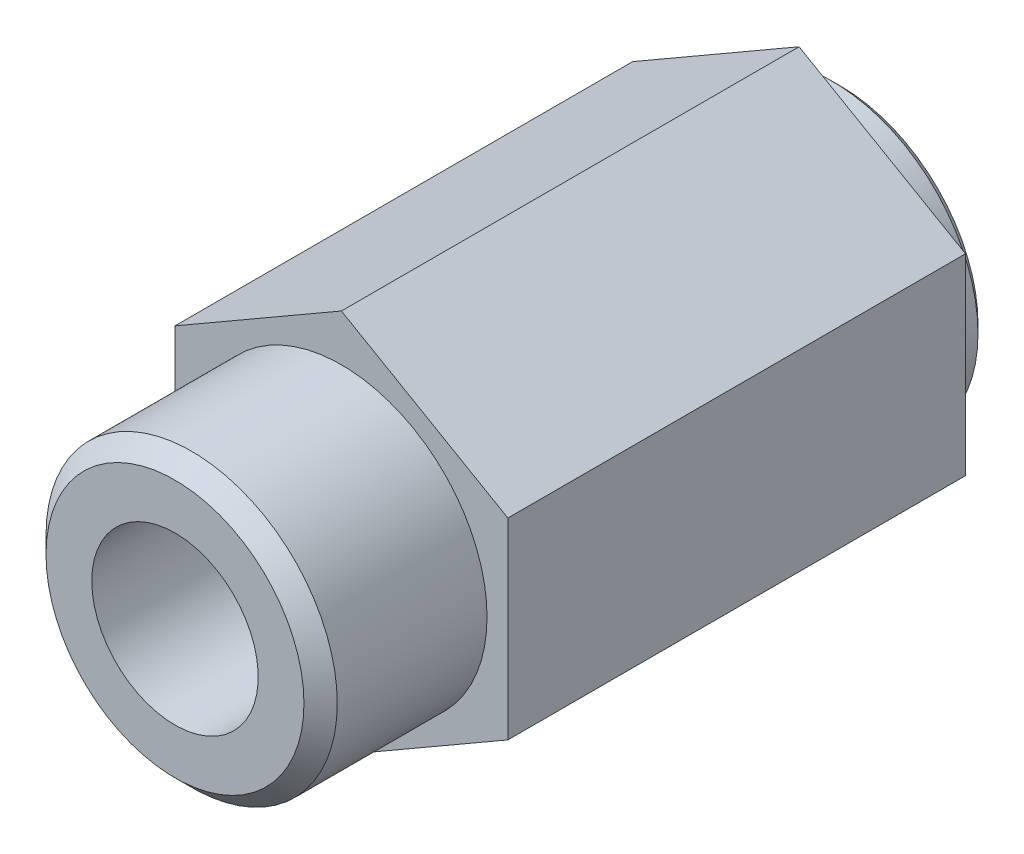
ISO-10303-21;
HEADER;
FILE_DESCRIPTION(('STEP AP214'),'2;1');
FILE_NAME('part.step','',(''),(''),'','','');
FILE_SCHEMA(('AUTOMOTIVE_DESIGN { 1 0 10303 214 1 1 1 1 }'));
ENDSEC;
DATA;
#1=APPLICATION_CONTEXT('core data for automotive mechanical design processes');
#2=APPLICATION_PROTOCOL_DEFINITION('international standard','automotive_design',2000,#1);
#3=PRODUCT_CONTEXT('',#1,'mechanical');
#4=PRODUCT('Part','Part','',(#3));
#5=PRODUCT_RELATED_PRODUCT_CATEGORY('part','',(#4));
#6=PRODUCT_DEFINITION_FORMATION('','',#4);
#7=PRODUCT_DEFINITION_CONTEXT('part definition',#1,'design');
#8=PRODUCT_DEFINITION('design','',#6,#7);
#9=PRODUCT_DEFINITION_SHAPE('','',#8);
#10=(LENGTH_UNIT() NAMED_UNIT(*) SI_UNIT(.MILLI.,.METRE.));
#11=(NAMED_UNIT(*) PLANE_ANGLE_UNIT() SI_UNIT($,.RADIAN.));
#12=(NAMED_UNIT(*) SI_UNIT($,.STERADIAN.) SOLID_ANGLE_UNIT());
#13=UNCERTAINTY_MEASURE_WITH_UNIT(LENGTH_MEASURE(1.E-05),#10,'distance_accuracy_value','');
#14=(GEOMETRIC_REPRESENTATION_CONTEXT(3) GLOBAL_UNCERTAINTY_ASSIGNED_CONTEXT((#13)) GLOBAL_UNIT_ASSIGNED_CONTEXT((#10,
#11,#12)) REPRESENTATION_CONTEXT('',''));
#15=CARTESIAN_POINT('',(0.,0.,0.));
#16=DIRECTION('',(0.,0.,1.));
#17=DIRECTION('',(1.,0.,0.));
#18=AXIS2_PLACEMENT_3D('',#15,#16,#17);
#19=CARTESIAN_POINT('',(20.,11.5470053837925,55.));
#20=DIRECTION('',(-0.5,-0.866025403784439,0.));
#21=DIRECTION('',(0.866025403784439,-0.5,0.));
#22=AXIS2_PLACEMENT_3D('',#19,#20,#21);
#23=PLANE('',#22);
#24=DIRECTION('',(-0.866025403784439,0.5,0.));
#25=VECTOR('',#24,1.);
#26=CARTESIAN_POINT('',(20.,11.5470053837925,0.));
#27=LINE('',#26,#25);
#28=CARTESIAN_POINT('',(20.,11.5470053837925,0.));
#29=VERTEX_POINT('',#28);
#30=CARTESIAN_POINT('',(0.,23.094010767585,0.));
#31=VERTEX_POINT('',#30);
#32=EDGE_CURVE('E125',#29,#31,#27,.T.);
#33=ORIENTED_EDGE('',*,*,#32,.T.);
#34=DIRECTION('',(0.,0.,-1.));
#35=VECTOR('',#34,1.);
#36=CARTESIAN_POINT('',(0.,23.094010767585,55.));
#37=LINE('',#36,#35);
#38=CARTESIAN_POINT('',(0.,23.094010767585,55.));
#39=VERTEX_POINT('',#38);
#40=EDGE_CURVE('E143',#39,#31,#37,.T.);
#41=ORIENTED_EDGE('',*,*,#40,.F.);
#42=DIRECTION('',(-0.866025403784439,0.5,0.));
#43=VECTOR('',#42,1.);
#44=CARTESIAN_POINT('',(20.,11.5470053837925,55.));
#45=LINE('',#44,#43);
#46=CARTESIAN_POINT('',(20.,11.5470053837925,55.));
#47=VERTEX_POINT('',#46);
#48=EDGE_CURVE('E136',#47,#39,#45,.T.);
#49=ORIENTED_EDGE('',*,*,#48,.F.);
#50=DIRECTION('',(0.,0.,-1.));
#51=VECTOR('',#50,1.);
#52=CARTESIAN_POINT('',(20.,11.5470053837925,55.));
#53=LINE('',#52,#51);
#54=EDGE_CURVE('E121',#47,#29,#53,.T.);
#55=ORIENTED_EDGE('',*,*,#54,.T.);
#56=EDGE_LOOP('',(#33,#41,#49,#55));
#57=FACE_BOUND('',#56,.T.);
#58=ADVANCED_FACE('F39',(#57),#23,.F.);
#59=CARTESIAN_POINT('',(0.,23.094010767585,55.));
#60=DIRECTION('',(0.5,-0.866025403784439,0.));
#61=DIRECTION('',(0.866025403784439,0.5,0.));
#62=AXIS2_PLACEMENT_3D('',#59,#60,#61);
#63=PLANE('',#62);
#64=DIRECTION('',(-0.866025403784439,-0.5,0.));
#65=VECTOR('',#64,1.);
#66=CARTESIAN_POINT('',(0.,23.094010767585,0.));
#67=LINE('',#66,#65);
#68=CARTESIAN_POINT('',(-20.,11.5470053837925,0.));
#69=VERTEX_POINT('',#68);
#70=EDGE_CURVE('E128',#31,#69,#67,.T.);
#71=ORIENTED_EDGE('',*,*,#70,.T.);
#72=DIRECTION('',(0.,0.,-1.));
#73=VECTOR('',#72,1.);
#74=CARTESIAN_POINT('',(-20.,11.5470053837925,55.));
#75=LINE('',#74,#73);
#76=CARTESIAN_POINT('',(-20.,11.5470053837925,55.));
#77=VERTEX_POINT('',#76);
#78=EDGE_CURVE('E140',#77,#69,#75,.T.);
#79=ORIENTED_EDGE('',*,*,#78,.F.);
#80=DIRECTION('',(-0.866025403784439,-0.5,0.));
#81=VECTOR('',#80,1.);
#82=CARTESIAN_POINT('',(0.,23.094010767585,55.));
#83=LINE('',#82,#81);
#84=EDGE_CURVE('E94',#39,#77,#83,.T.);
#85=ORIENTED_EDGE('',*,*,#84,.F.);
#86=ORIENTED_EDGE('',*,*,#40,.T.);
#87=EDGE_LOOP('',(#71,#79,#85,#86));
#88=FACE_BOUND('',#87,.T.);
#89=ADVANCED_FACE('F169',(#88),#63,.F.);
#90=CARTESIAN_POINT('',(-20.,11.5470053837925,55.));
#91=DIRECTION('',(1.,0.,0.));
#92=DIRECTION('',(0.,1.,0.));
#93=AXIS2_PLACEMENT_3D('',#90,#91,#92);
#94=PLANE('',#93);
#95=DIRECTION('',(0.,-1.,0.));
#96=VECTOR('',#95,1.);
#97=CARTESIAN_POINT('',(-20.,11.5470053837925,0.));
#98=LINE('',#97,#96);
#99=CARTESIAN_POINT('',(-20.,-11.5470053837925,0.));
#100=VERTEX_POINT('',#99);
#101=EDGE_CURVE('E131',#69,#100,#98,.T.);
#102=ORIENTED_EDGE('',*,*,#101,.T.);
#103=DIRECTION('',(0.,0.,-1.));
#104=VECTOR('',#103,1.);
#105=CARTESIAN_POINT('',(-20.,-11.5470053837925,55.));
#106=LINE('',#105,#104);
#107=CARTESIAN_POINT('',(-20.,-11.5470053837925,55.));
#108=VERTEX_POINT('',#107);
#109=EDGE_CURVE('E116',#108,#100,#106,.T.);
#110=ORIENTED_EDGE('',*,*,#109,.F.);
#111=DIRECTION('',(0.,-1.,0.));
#112=VECTOR('',#111,1.);
#113=CARTESIAN_POINT('',(-20.,11.5470053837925,55.));
#114=LINE('',#113,#112);
#115=EDGE_CURVE('E107',#77,#108,#114,.T.);
#116=ORIENTED_EDGE('',*,*,#115,.F.);
#117=ORIENTED_EDGE('',*,*,#78,.T.);
#118=EDGE_LOOP('',(#102,#110,#116,#117));
#119=FACE_BOUND('',#118,.T.);
#120=ADVANCED_FACE('F175',(#119),#94,.F.);
#121=CARTESIAN_POINT('',(-20.,-11.5470053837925,55.));
#122=DIRECTION('',(0.5,0.866025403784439,0.));
#123=DIRECTION('',(-0.866025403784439,0.5,0.));
#124=AXIS2_PLACEMENT_3D('',#121,#122,#123);
#125=PLANE('',#124);
#126=DIRECTION('',(0.866025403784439,-0.5,0.));
#127=VECTOR('',#126,1.);
#128=CARTESIAN_POINT('',(-20.,-11.5470053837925,0.));
#129=LINE('',#128,#127);
#130=CARTESIAN_POINT('',(0.,-23.094010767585,0.));
#131=VERTEX_POINT('',#130);
#132=EDGE_CURVE('E115',#100,#131,#129,.T.);
#133=ORIENTED_EDGE('',*,*,#132,.T.);
#134=DIRECTION('',(0.,0.,-1.));
#135=VECTOR('',#134,1.);
#136=CARTESIAN_POINT('',(0.,-23.094010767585,55.));
#137=LINE('',#136,#135);
#138=CARTESIAN_POINT('',(0.,-23.094010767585,55.));
#139=VERTEX_POINT('',#138);
#140=EDGE_CURVE('E112',#139,#131,#137,.T.);
#141=ORIENTED_EDGE('',*,*,#140,.F.);
#142=DIRECTION('',(0.866025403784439,-0.5,0.));
#143=VECTOR('',#142,1.);
#144=CARTESIAN_POINT('',(-20.,-11.5470053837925,55.));
#145=LINE('',#144,#143);
#146=EDGE_CURVE('E101',#108,#139,#145,.T.);
#147=ORIENTED_EDGE('',*,*,#146,.F.);
#148=ORIENTED_EDGE('',*,*,#109,.T.);
#149=EDGE_LOOP('',(#133,#141,#147,#148));
#150=FACE_BOUND('',#149,.T.);
#151=ADVANCED_FACE('F113',(#150),#125,.F.);
#152=CARTESIAN_POINT('',(0.,-23.094010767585,55.));
#153=DIRECTION('',(-0.5,0.866025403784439,0.));
#154=DIRECTION('',(-0.866025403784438,-0.5,0.));
#155=AXIS2_PLACEMENT_3D('',#152,#153,#154);
#156=PLANE('',#155);
#157=DIRECTION('',(0.866025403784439,0.5,0.));
#158=VECTOR('',#157,1.);
#159=CARTESIAN_POINT('',(0.,-23.094010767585,0.));
#160=LINE('',#159,#158);
#161=CARTESIAN_POINT('',(20.,-11.5470053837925,0.));
#162=VERTEX_POINT('',#161);
#163=EDGE_CURVE('E79',#131,#162,#160,.T.);
#164=ORIENTED_EDGE('',*,*,#163,.T.);
#165=DIRECTION('',(0.,0.,-1.));
#166=VECTOR('',#165,1.);
#167=CARTESIAN_POINT('',(20.,-11.5470053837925,55.));
#168=LINE('',#167,#166);
#169=CARTESIAN_POINT('',(20.,-11.5470053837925,55.));
#170=VERTEX_POINT('',#169);
#171=EDGE_CURVE('E117',#170,#162,#168,.T.);
#172=ORIENTED_EDGE('',*,*,#171,.F.);
#173=DIRECTION('',(0.866025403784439,0.5,0.));
#174=VECTOR('',#173,1.);
#175=CARTESIAN_POINT('',(0.,-23.094010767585,55.));
#176=LINE('',#175,#174);
#177=EDGE_CURVE('E105',#139,#170,#176,.T.);
#178=ORIENTED_EDGE('',*,*,#177,.F.);
#179=ORIENTED_EDGE('',*,*,#140,.T.);
#180=EDGE_LOOP('',(#164,#172,#178,#179));
#181=FACE_BOUND('',#180,.T.);
#182=ADVANCED_FACE('F119',(#181),#156,.F.);
#183=CARTESIAN_POINT('',(20.,-11.5470053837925,55.));
#184=DIRECTION('',(-1.,0.,0.));
#185=DIRECTION('',(0.,0.,1.));
#186=AXIS2_PLACEMENT_3D('',#183,#184,#185);
#187=PLANE('',#186);
#188=DIRECTION('',(0.,1.,0.));
#189=VECTOR('',#188,1.);
#190=CARTESIAN_POINT('',(20.,-11.5470053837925,0.));
#191=LINE('',#190,#189);
#192=EDGE_CURVE('E85',#162,#29,#191,.T.);
#193=ORIENTED_EDGE('',*,*,#192,.T.);
#194=ORIENTED_EDGE('',*,*,#54,.F.);
#195=DIRECTION('',(0.,1.,0.));
#196=VECTOR('',#195,1.);
#197=CARTESIAN_POINT('',(20.,-11.5470053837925,55.));
#198=LINE('',#197,#196);
#199=EDGE_CURVE('E56',#170,#47,#198,.T.);
#200=ORIENTED_EDGE('',*,*,#199,.F.);
#201=ORIENTED_EDGE('',*,*,#171,.T.);
#202=EDGE_LOOP('',(#193,#194,#200,#201));
#203=FACE_BOUND('',#202,.T.);
#204=ADVANCED_FACE('F185',(#203),#187,.F.);
#205=CARTESIAN_POINT('',(0.,0.,55.));
#206=DIRECTION('',(0.,0.,1.));
#207=DIRECTION('',(1.,0.,0.));
#208=AXIS2_PLACEMENT_3D('',#205,#206,#207);
#209=PLANE('',#208);
#210=CARTESIAN_POINT('',(0.,0.,55.));
#211=DIRECTION('',(0.,0.,1.));
#212=DIRECTION('',(1.,0.,0.));
#213=AXIS2_PLACEMENT_3D('',#210,#211,#212);
#214=CIRCLE('',#213,17.5);
#215=CARTESIAN_POINT('',(17.5,0.,55.));
#216=VERTEX_POINT('',#215);
#217=EDGE_CURVE('E129',#216,#216,#214,.T.);
#218=ORIENTED_EDGE('',*,*,#217,.F.);
#219=EDGE_LOOP('',(#218));
#220=FACE_BOUND('',#219,.T.);
#221=ORIENTED_EDGE('',*,*,#48,.T.);
#222=ORIENTED_EDGE('',*,*,#84,.T.);
#223=ORIENTED_EDGE('',*,*,#115,.T.);
#224=ORIENTED_EDGE('',*,*,#146,.T.);
#225=ORIENTED_EDGE('',*,*,#177,.T.);
#226=ORIENTED_EDGE('',*,*,#199,.T.);
#227=EDGE_LOOP('',(#221,#222,#223,#224,#225,#226));
#228=FACE_BOUND('',#227,.T.);
#229=ADVANCED_FACE('F103',(#220,#228),#209,.T.);
#230=CARTESIAN_POINT('',(0.,0.,0.));
#231=DIRECTION('',(0.,0.,1.));
#232=DIRECTION('',(1.,0.,0.));
#233=AXIS2_PLACEMENT_3D('',#230,#231,#232);
#234=PLANE('',#233);
#235=CARTESIAN_POINT('',(0.,0.,0.));
#236=DIRECTION('',(0.,0.,1.));
#237=DIRECTION('',(1.,0.,0.));
#238=AXIS2_PLACEMENT_3D('',#235,#236,#237);
#239=CIRCLE('',#238,17.5);
#240=CARTESIAN_POINT('',(17.5,0.,0.));
#241=VERTEX_POINT('',#240);
#242=EDGE_CURVE('E145',#241,#241,#239,.F.);
#243=ORIENTED_EDGE('',*,*,#242,.F.);
#244=EDGE_LOOP('',(#243));
#245=FACE_BOUND('',#244,.T.);
#246=ORIENTED_EDGE('',*,*,#32,.F.);
#247=ORIENTED_EDGE('',*,*,#192,.F.);
#248=ORIENTED_EDGE('',*,*,#163,.F.);
#249=ORIENTED_EDGE('',*,*,#132,.F.);
#250=ORIENTED_EDGE('',*,*,#101,.F.);
#251=ORIENTED_EDGE('',*,*,#70,.F.);
#252=EDGE_LOOP('',(#246,#247,#248,#249,#250,#251));
#253=FACE_BOUND('',#252,.T.);
#254=ADVANCED_FACE('F188',(#245,#253),#234,.F.);
#255=CARTESIAN_POINT('',(0.,0.,75.));
#256=DIRECTION('',(0.,0.,-1.));
#257=DIRECTION('',(-1.,0.,0.));
#258=AXIS2_PLACEMENT_3D('',#255,#256,#257);
#259=CYLINDRICAL_SURFACE('',#258,17.5);
#260=CARTESIAN_POINT('',(0.,0.,73.));
#261=DIRECTION('',(0.,0.,1.));
#262=DIRECTION('',(1.,0.,0.));
#263=AXIS2_PLACEMENT_3D('',#260,#261,#262);
#264=CIRCLE('',#263,17.5);
#265=CARTESIAN_POINT('',(17.5,0.,73.));
#266=VERTEX_POINT('',#265);
#267=EDGE_CURVE('E151',#266,#266,#264,.F.);
#268=ORIENTED_EDGE('',*,*,#267,.T.);
#269=EDGE_LOOP('',(#268));
#270=FACE_BOUND('',#269,.T.);
#271=ORIENTED_EDGE('',*,*,#217,.T.);
#272=EDGE_LOOP('',(#271));
#273=FACE_BOUND('',#272,.T.);
#274=ADVANCED_FACE('F191',(#270,#273),#259,.T.);
#275=CARTESIAN_POINT('',(0.,0.,75.));
#276=DIRECTION('',(0.,0.,1.));
#277=DIRECTION('',(1.,0.,0.));
#278=AXIS2_PLACEMENT_3D('',#275,#276,#277);
#279=PLANE('',#278);
#280=CARTESIAN_POINT('',(0.,0.,75.));
#281=DIRECTION('',(0.,0.,1.));
#282=DIRECTION('',(1.,0.,0.));
#283=AXIS2_PLACEMENT_3D('',#280,#281,#282);
#284=CIRCLE('',#283,15.5);
#285=CARTESIAN_POINT('',(15.5,0.,75.));
#286=VERTEX_POINT('',#285);
#287=EDGE_CURVE('E148',#286,#286,#284,.T.);
#288=ORIENTED_EDGE('',*,*,#287,.T.);
#289=EDGE_LOOP('',(#288));
#290=FACE_BOUND('',#289,.T.);
#291=CARTESIAN_POINT('',(0.,0.,75.));
#292=DIRECTION('',(0.,0.,-1.));
#293=DIRECTION('',(-1.,0.,0.));
#294=AXIS2_PLACEMENT_3D('',#291,#292,#293);
#295=CIRCLE('',#294,10.);
#296=CARTESIAN_POINT('',(-10.,0.,75.));
#297=VERTEX_POINT('',#296);
#298=EDGE_CURVE('E216',#297,#297,#295,.T.);
#299=ORIENTED_EDGE('',*,*,#298,.T.);
#300=EDGE_LOOP('',(#299));
#301=FACE_BOUND('',#300,.T.);
#302=ADVANCED_FACE('F198',(#290,#301),#279,.T.);
#303=CARTESIAN_POINT('',(0.,0.,-5.));
#304=DIRECTION('',(0.,0.,1.));
#305=DIRECTION('',(1.,0.,0.));
#306=AXIS2_PLACEMENT_3D('',#303,#304,#305);
#307=CYLINDRICAL_SURFACE('',#306,17.5);
#308=CARTESIAN_POINT('',(0.,0.,-4.00000000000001));
#309=DIRECTION('',(0.,0.,-1.));
#310=DIRECTION('',(-1.,0.,0.));
#311=AXIS2_PLACEMENT_3D('',#308,#309,#310);
#312=CIRCLE('',#311,17.5);
#313=CARTESIAN_POINT('',(-17.5,0.,-4.00000000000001));
#314=VERTEX_POINT('',#313);
#315=EDGE_CURVE('E11',#314,#314,#312,.F.);
#316=ORIENTED_EDGE('',*,*,#315,.T.);
#317=EDGE_LOOP('',(#316));
#318=FACE_BOUND('',#317,.T.);
#319=ORIENTED_EDGE('',*,*,#242,.T.);
#320=EDGE_LOOP('',(#319));
#321=FACE_BOUND('',#320,.T.);
#322=ADVANCED_FACE('F202',(#318,#321),#307,.T.);
#323=CARTESIAN_POINT('',(0.,0.,-5.));
#324=DIRECTION('',(0.,0.,-1.));
#325=DIRECTION('',(-1.,0.,0.));
#326=AXIS2_PLACEMENT_3D('',#323,#324,#325);
#327=PLANE('',#326);
#328=CARTESIAN_POINT('',(0.,0.,-5.));
#329=DIRECTION('',(0.,0.,-1.));
#330=DIRECTION('',(-1.,0.,0.));
#331=AXIS2_PLACEMENT_3D('',#328,#329,#330);
#332=CIRCLE('',#331,16.5);
#333=CARTESIAN_POINT('',(-16.5,0.,-5.));
#334=VERTEX_POINT('',#333);
#335=EDGE_CURVE('E48',#334,#334,#332,.T.);
#336=ORIENTED_EDGE('',*,*,#335,.T.);
#337=EDGE_LOOP('',(#336));
#338=FACE_BOUND('',#337,.T.);
#339=CARTESIAN_POINT('',(0.,0.,-5.));
#340=DIRECTION('',(0.,0.,-1.));
#341=DIRECTION('',(-1.,0.,0.));
#342=AXIS2_PLACEMENT_3D('',#339,#340,#341);
#343=CIRCLE('',#342,10.);
#344=CARTESIAN_POINT('',(-10.,0.,-5.));
#345=VERTEX_POINT('',#344);
#346=EDGE_CURVE('E219',#345,#345,#343,.T.);
#347=ORIENTED_EDGE('',*,*,#346,.F.);
#348=EDGE_LOOP('',(#347));
#349=FACE_BOUND('',#348,.T.);
#350=ADVANCED_FACE('F156',(#338,#349),#327,.T.);
#351=CARTESIAN_POINT('',(0.,0.,75.));
#352=DIRECTION('',(0.,0.,-1.));
#353=DIRECTION('',(-1.,0.,0.));
#354=AXIS2_PLACEMENT_3D('',#351,#352,#353);
#355=CYLINDRICAL_SURFACE('',#354,10.);
#356=ORIENTED_EDGE('',*,*,#298,.F.);
#357=EDGE_LOOP('',(#356));
#358=FACE_BOUND('',#357,.T.);
#359=ORIENTED_EDGE('',*,*,#346,.T.);
#360=EDGE_LOOP('',(#359));
#361=FACE_BOUND('',#360,.T.);
#362=ADVANCED_FACE('F165',(#358,#361),#355,.F.);
#363=CARTESIAN_POINT('',(0.,0.,75.));
#364=DIRECTION('',(0.,0.,-1.));
#365=DIRECTION('',(-1.,0.,0.));
#366=AXIS2_PLACEMENT_3D('',#363,#364,#365);
#367=CONICAL_SURFACE('',#366,15.5,0.785398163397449);
#368=ORIENTED_EDGE('',*,*,#267,.F.);
#369=EDGE_LOOP('',(#368));
#370=FACE_BOUND('',#369,.T.);
#371=ORIENTED_EDGE('',*,*,#287,.F.);
#372=EDGE_LOOP('',(#371));
#373=FACE_BOUND('',#372,.T.);
#374=ADVANCED_FACE('F160',(#370,#373),#367,.T.);
#375=CARTESIAN_POINT('',(0.,0.,-5.));
#376=DIRECTION('',(0.,0.,1.));
#377=DIRECTION('',(1.,0.,0.));
#378=AXIS2_PLACEMENT_3D('',#375,#376,#377);
#379=CONICAL_SURFACE('',#378,16.5,0.785398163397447);
#380=ORIENTED_EDGE('',*,*,#315,.F.);
#381=EDGE_LOOP('',(#380));
#382=FACE_BOUND('',#381,.T.);
#383=ORIENTED_EDGE('',*,*,#335,.F.);
#384=EDGE_LOOP('',(#383));
#385=FACE_BOUND('',#384,.T.);
#386=ADVANCED_FACE('F41',(#382,#385),#379,.T.);
#387=CLOSED_SHELL('',(#58,#89,#120,#151,#182,#204,#229,#254,#274,#302,#322,#350,#362,#374,#386));
#388=MANIFOLD_SOLID_BREP('B2',#387);
#389=ADVANCED_BREP_SHAPE_REPRESENTATION('',(#18,#388),#14);
#390=SHAPE_DEFINITION_REPRESENTATION(#9,#389);
ENDSEC;
END-ISO-10303-21;
